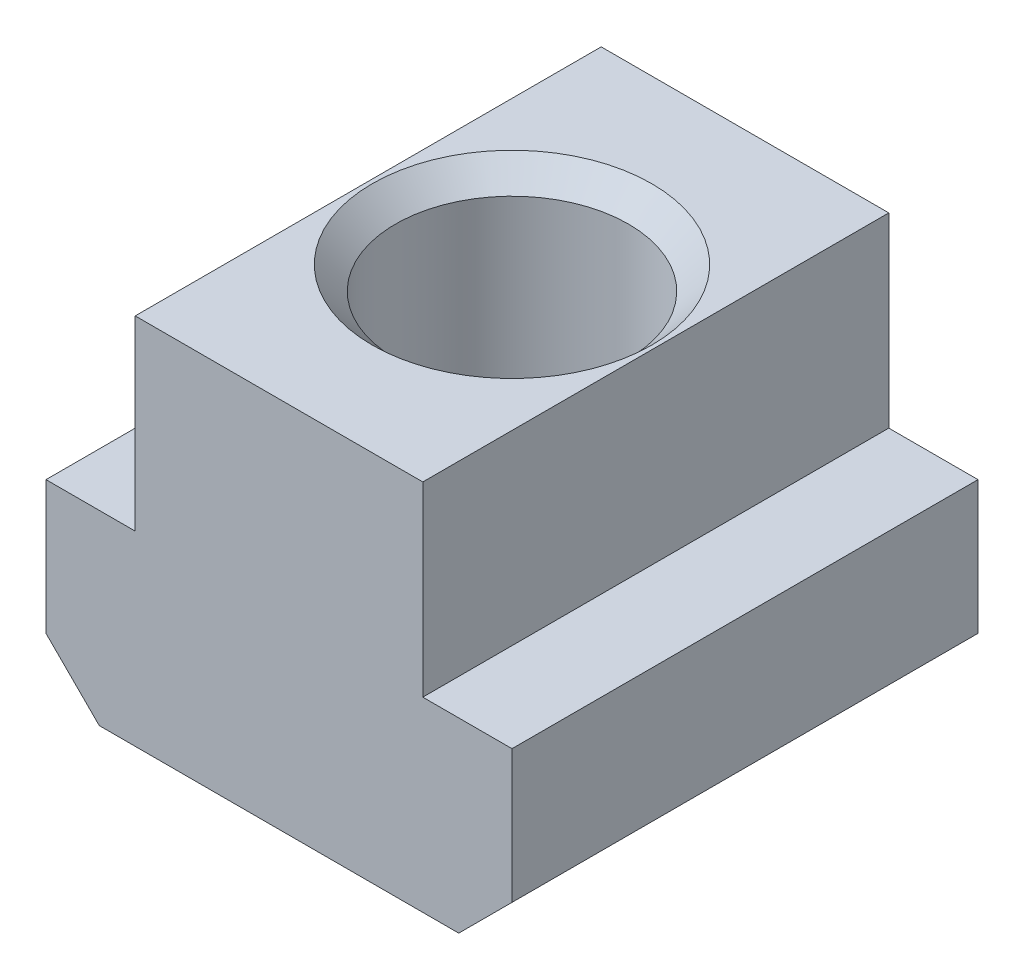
from build123d import *

# Parameters (mm, degrees)
BOSS_EXTRU_1_DEPTH           = 17.5
TROU_TARAUD_M201_D           = 17.5
TROU_TARAUD_M201_CSINK_D     = 21
TROU_TARAUD_M201_CSINK_ANGLE = 90
CHANFREIN1_SIZE              = 4


with BuildPart() as part:
    # Esquisse1 → Boss.-Extru.1 (new, symmetric)
    with BuildSketch(Plane.XY):
        Polygon((10.8, 0), (17.5, 0), (17.5, -14), (-17.5, -14), (-17.5, 0), (-10.8, 0), (-10.8, 14), (10.8, 14), align=None)
    extrude(amount=BOSS_EXTRU_1_DEPTH, both=True)

    # Trou taraud_ M201 (through all)
    with Locations(Plane(origin=(0, 14, 0), x_dir=(1, 0, 0), z_dir=(0, 1, 0))):
        with Locations((0, 0)):
            CounterSinkHole(TROU_TARAUD_M201_D / 2, TROU_TARAUD_M201_CSINK_D / 2, counter_sink_angle=TROU_TARAUD_M201_CSINK_ANGLE)

    # Chanfrein1
    chanfrein1_edges = [part.edges().sort_by_distance(p)[0] for p in [
        (17.5, -14, 0),
        (-17.5, -14, 0),
    ]]
    chamfer(chanfrein1_edges, length=CHANFREIN1_SIZE)


solid = part.part
